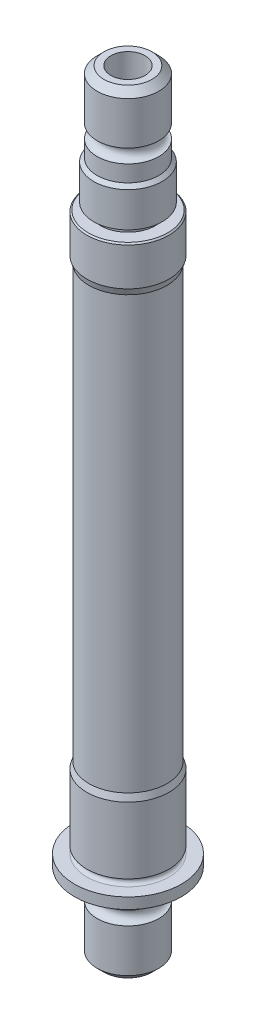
from build123d import *

# Parameters (mm, degrees)
EXTRUSION1_DEPTH = 3
ESQUISSE3_W      = 2.5
ESQUISSE3_H      = 109.9


with BuildPart() as part:
    # Esquisse1 → R_volution1 (revolve)
    with BuildSketch(Plane(origin=(0, 0, 0), x_dir=(-1, 0, 0), z_dir=(0, 0, -1)), mode=Mode.PRIVATE) as r_volution1_sk:
        with BuildLine():
            Line((-3.5, -113.900475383), (0, -113.900475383))
            Line((0, -113.900475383), (0, -1.000475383))
            Line((0, -1.000475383), (-3.5, -1.000475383))
            Line((-3.5, -1.000475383), (-4.5, -2.000475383))
            Line((-4.5, -2.000475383), (-4.5, -8.256950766))
            ThreePointArc((-4.5, -8.256950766), (-3.5, -9.256950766), (-4.5, -10.256950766))
            Line((-4.5, -10.256950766), (-4.5, -12.656950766))
            Line((-4.5, -12.656950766), (-5, -13.156950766))
            Line((-5, -13.156950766), (-5, -18.250950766))
            Line((-5, -18.250950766), (-4, -18.250950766))
            Line((-4, -18.250950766), (-4, -19.250950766))
            Line((-4, -19.250950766), (-5.8, -19.250950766))
            Line((-5.8, -19.250950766), (-6, -19.450950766))
            Line((-6, -19.450950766), (-6, -25.000475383))
            Line((-6, -25.000475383), (-5.7, -25.954414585))
            Line((-5.7, -25.954414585), (-5.7, -88.946536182))
            Line((-5.7, -88.946536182), (-6, -89.900475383))
            Line((-6, -89.900475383), (-6, -99.610475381))
            ThreePointArc((-6, -99.610475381), (-5.499999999, -100.11050796), (-6.000065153, -100.610475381))
            Line((-6.000065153, -100.610475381), (-7.8, -100.610475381))
            Line((-7.8, -100.610475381), (-7.8, -102.210475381))
            Line((-7.8, -102.210475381), (-4.5, -102.210475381))
            Line((-4.5, -102.210475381), (-4.5, -104.610475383))
            ThreePointArc((-4.5, -104.610475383), (-3.5, -105.610475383), (-4.5, -106.610475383))
            Line((-4.5, -106.610475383), (-4.5, -112.900475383))
            Line((-4.5, -112.900475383), (-3.5, -113.900475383))
        make_face()
    revolve(r_volution1_sk.sketch.rotate(Axis((0, -113.900475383, 0), (0, 1, 0)), 270), axis=Axis((0, -113.900475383, 0), (0, 1, 0)))

    # Esquisse2 → Extrusion1 (cut)
    with BuildSketch(Plane.XZ.offset(113.900475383)):
        Polygon((1.732050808, -3), (3.464101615, 0), (1.732050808, 3), (-1.732050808, 3), (-3.464101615, 0), (-1.732050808, -3), align=None)
    extrude(amount=-EXTRUSION1_DEPTH, mode=Mode.SUBTRACT)

    # Esquisse3 → Enl_vement de mati_re-R_volution1 (revolve, cut)
    with BuildSketch(Plane.XY, mode=Mode.PRIVATE) as enl_vement_de_mati_re_r_volution1_sk:
        with Locations((1.25, -55.950475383)):
            Rectangle(ESQUISSE3_W, ESQUISSE3_H)
    revolve(enl_vement_de_mati_re_r_volution1_sk.sketch.rotate(Axis((0, -1.000475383, 0), (0, -1, 0)), 90), axis=Axis((0, -1.000475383, 0), (0, -1, 0)), mode=Mode.SUBTRACT)


solid = part.part
